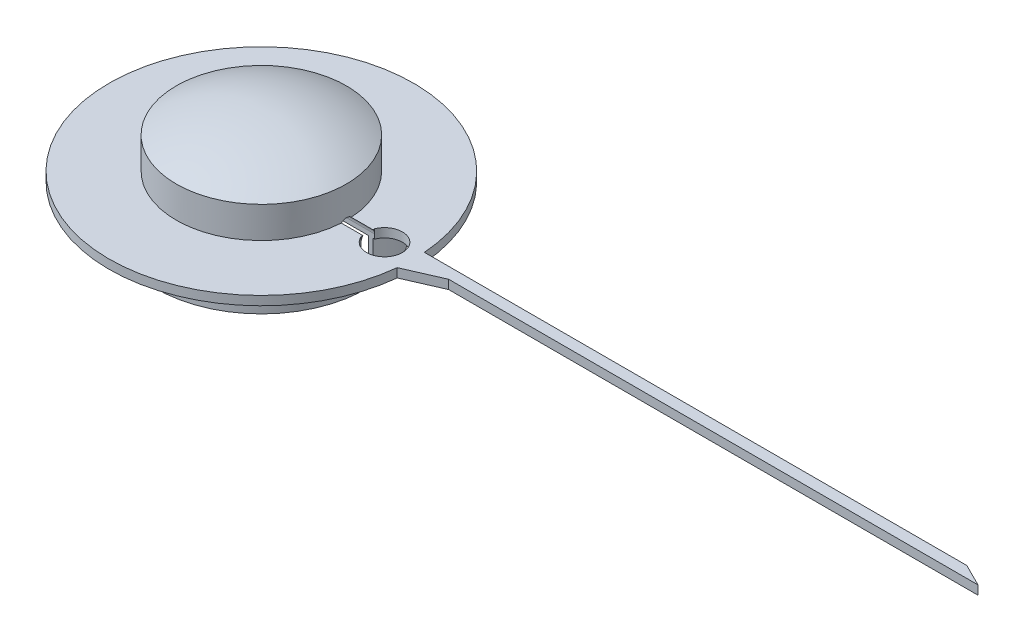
ISO-10303-21;
HEADER;
FILE_DESCRIPTION(('STEP AP214'),'2;1');
FILE_NAME('part.step','',(''),(''),'','','');
FILE_SCHEMA(('AUTOMOTIVE_DESIGN { 1 0 10303 214 1 1 1 1 }'));
ENDSEC;
DATA;
#1=APPLICATION_CONTEXT('core data for automotive mechanical design processes');
#2=APPLICATION_PROTOCOL_DEFINITION('international standard','automotive_design',2000,#1);
#3=PRODUCT_CONTEXT('',#1,'mechanical');
#4=PRODUCT('Part','Part','',(#3));
#5=PRODUCT_RELATED_PRODUCT_CATEGORY('part','',(#4));
#6=PRODUCT_DEFINITION_FORMATION('','',#4);
#7=PRODUCT_DEFINITION_CONTEXT('part definition',#1,'design');
#8=PRODUCT_DEFINITION('design','',#6,#7);
#9=PRODUCT_DEFINITION_SHAPE('','',#8);
#10=(LENGTH_UNIT() NAMED_UNIT(*) SI_UNIT(.MILLI.,.METRE.));
#11=(NAMED_UNIT(*) PLANE_ANGLE_UNIT() SI_UNIT($,.RADIAN.));
#12=(NAMED_UNIT(*) SI_UNIT($,.STERADIAN.) SOLID_ANGLE_UNIT());
#13=UNCERTAINTY_MEASURE_WITH_UNIT(LENGTH_MEASURE(1.E-05),#10,'distance_accuracy_value','');
#14=(GEOMETRIC_REPRESENTATION_CONTEXT(3) GLOBAL_UNCERTAINTY_ASSIGNED_CONTEXT((#13)) GLOBAL_UNIT_ASSIGNED_CONTEXT((#10,
#11,#12)) REPRESENTATION_CONTEXT('',''));
#15=CARTESIAN_POINT('',(0.,0.,0.));
#16=DIRECTION('',(0.,0.,1.));
#17=DIRECTION('',(1.,0.,0.));
#18=AXIS2_PLACEMENT_3D('',#15,#16,#17);
#19=CARTESIAN_POINT('',(5.,-18.5825859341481,-0.75));
#20=DIRECTION('',(0.,0.,-1.));
#21=DIRECTION('',(-1.,0.,0.));
#22=AXIS2_PLACEMENT_3D('',#19,#20,#21);
#23=PLANE('',#22);
#24=DIRECTION('',(-1.,0.,0.));
#25=VECTOR('',#24,1.);
#26=CARTESIAN_POINT('',(11.8959503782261,0.5,-0.75));
#27=LINE('',#26,#25);
#28=CARTESIAN_POINT('',(11.8959503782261,0.5,-0.75));
#29=VERTEX_POINT('',#28);
#30=CARTESIAN_POINT('',(5.,0.5,-0.75));
#31=VERTEX_POINT('',#30);
#32=EDGE_CURVE('E303',#29,#31,#27,.T.);
#33=ORIENTED_EDGE('',*,*,#32,.T.);
#34=DIRECTION('',(0.,1.,0.));
#35=VECTOR('',#34,1.);
#36=CARTESIAN_POINT('',(5.,-18.5825859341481,-0.75));
#37=LINE('',#36,#35);
#38=CARTESIAN_POINT('',(5.,0.,-0.75));
#39=VERTEX_POINT('',#38);
#40=EDGE_CURVE('E534',#39,#31,#37,.T.);
#41=ORIENTED_EDGE('',*,*,#40,.F.);
#42=DIRECTION('',(1.,0.,0.));
#43=VECTOR('',#42,1.);
#44=CARTESIAN_POINT('',(5.,0.,-0.75));
#45=LINE('',#44,#43);
#46=CARTESIAN_POINT('',(11.2249721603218,0.,-0.75));
#47=VERTEX_POINT('',#46);
#48=EDGE_CURVE('E496',#39,#47,#45,.T.);
#49=ORIENTED_EDGE('',*,*,#48,.T.);
#50=DIRECTION('',(0.,1.,0.));
#51=VECTOR('',#50,1.);
#52=CARTESIAN_POINT('',(11.2249721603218,-4.5,-0.749999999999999));
#53=LINE('',#52,#51);
#54=CARTESIAN_POINT('',(11.2249721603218,-4.5,-0.749999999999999));
#55=VERTEX_POINT('',#54);
#56=EDGE_CURVE('E470',#47,#55,#53,.F.);
#57=ORIENTED_EDGE('',*,*,#56,.T.);
#58=DIRECTION('',(-1.,0.,0.));
#59=VECTOR('',#58,1.);
#60=CARTESIAN_POINT('',(17.001,-4.5,-0.749999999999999));
#61=LINE('',#60,#59);
#62=CARTESIAN_POINT('',(11.7260393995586,-4.5,-0.749999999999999));
#63=VERTEX_POINT('',#62);
#64=EDGE_CURVE('E310',#63,#55,#61,.T.);
#65=ORIENTED_EDGE('',*,*,#64,.F.);
#66=DIRECTION('',(0.,1.,0.));
#67=VECTOR('',#66,1.);
#68=CARTESIAN_POINT('',(11.7260393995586,-4.5,-0.749999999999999));
#69=LINE('',#68,#67);
#70=CARTESIAN_POINT('',(11.7260393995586,0.,-0.75));
#71=VERTEX_POINT('',#70);
#72=EDGE_CURVE('E313',#71,#63,#69,.F.);
#73=ORIENTED_EDGE('',*,*,#72,.F.);
#74=CARTESIAN_POINT('',(11.8959503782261,0.,-0.75));
#75=VERTEX_POINT('',#74);
#76=EDGE_CURVE('E495',#71,#75,#45,.T.);
#77=ORIENTED_EDGE('',*,*,#76,.T.);
#78=DIRECTION('',(0.,1.,0.));
#79=VECTOR('',#78,1.);
#80=CARTESIAN_POINT('',(11.8959503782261,-18.5825859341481,-0.75));
#81=LINE('',#80,#79);
#82=EDGE_CURVE('E537',#75,#29,#81,.T.);
#83=ORIENTED_EDGE('',*,*,#82,.T.);
#84=EDGE_LOOP('',(#33,#41,#49,#57,#65,#73,#77,#83));
#85=FACE_BOUND('',#84,.T.);
#86=ADVANCED_FACE('F32',(#85),#23,.F.);
#87=CARTESIAN_POINT('',(0.,0.,0.));
#88=DIRECTION('',(0.,1.,0.));
#89=DIRECTION('',(0.,0.,1.));
#90=AXIS2_PLACEMENT_3D('',#87,#88,#89);
#91=PLANE('',#90);
#92=CARTESIAN_POINT('',(0.,0.,0.));
#93=DIRECTION('',(0.,1.,0.));
#94=DIRECTION('',(0.,0.,1.));
#95=AXIS2_PLACEMENT_3D('',#92,#93,#94);
#96=CIRCLE('',#95,17.);
#97=CARTESIAN_POINT('',(16.953981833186,0.,-1.25000000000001));
#98=VERTEX_POINT('',#97);
#99=CARTESIAN_POINT('',(16.9096865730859,0.,1.74999999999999));
#100=VERTEX_POINT('',#99);
#101=EDGE_CURVE('E452',#98,#100,#96,.T.);
#102=ORIENTED_EDGE('',*,*,#101,.F.);
#103=DIRECTION('',(1.,0.,0.));
#104=VECTOR('',#103,1.);
#105=CARTESIAN_POINT('',(20.9096865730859,0.,-1.25000000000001));
#106=LINE('',#105,#104);
#107=CARTESIAN_POINT('',(77.5,0.,-1.25000000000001));
#108=VERTEX_POINT('',#107);
#109=EDGE_CURVE('E670',#98,#108,#106,.T.);
#110=ORIENTED_EDGE('',*,*,#109,.T.);
#111=DIRECTION('',(0.894427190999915,0.,0.44721359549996));
#112=VECTOR('',#111,1.);
#113=CARTESIAN_POINT('',(77.5,0.,-1.25000000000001));
#114=LINE('',#113,#112);
#115=CARTESIAN_POINT('',(80.,0.,0.));
#116=VERTEX_POINT('',#115);
#117=EDGE_CURVE('E252',#108,#116,#114,.T.);
#118=ORIENTED_EDGE('',*,*,#117,.T.);
#119=DIRECTION('',(-1.,0.,0.));
#120=VECTOR('',#119,1.);
#121=CARTESIAN_POINT('',(80.,0.,0.));
#122=LINE('',#121,#120);
#123=CARTESIAN_POINT('',(20.9096865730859,0.,0.));
#124=VERTEX_POINT('',#123);
#125=EDGE_CURVE('E263',#116,#124,#122,.T.);
#126=ORIENTED_EDGE('',*,*,#125,.T.);
#127=DIRECTION('',(-0.916157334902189,0.,0.400818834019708));
#128=VECTOR('',#127,1.);
#129=CARTESIAN_POINT('',(20.9096865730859,0.,0.));
#130=LINE('',#129,#128);
#131=EDGE_CURVE('E260',#124,#100,#130,.T.);
#132=ORIENTED_EDGE('',*,*,#131,.T.);
#133=EDGE_LOOP('',(#102,#110,#118,#126,#132));
#134=FACE_BOUND('',#133,.T.);
#135=CARTESIAN_POINT('',(0.,0.,0.));
#136=DIRECTION('',(0.,-1.,0.));
#137=DIRECTION('',(0.,0.,-1.));
#138=AXIS2_PLACEMENT_3D('',#135,#136,#137);
#139=CIRCLE('',#138,11.75);
#140=CARTESIAN_POINT('',(11.7260393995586,0.,0.75));
#141=VERTEX_POINT('',#140);
#142=EDGE_CURVE('E471',#141,#71,#139,.T.);
#143=ORIENTED_EDGE('',*,*,#142,.F.);
#144=DIRECTION('',(-1.,0.,0.));
#145=VECTOR('',#144,1.);
#146=CARTESIAN_POINT('',(5.,0.,0.75));
#147=LINE('',#146,#145);
#148=CARTESIAN_POINT('',(11.8959503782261,0.,0.75));
#149=VERTEX_POINT('',#148);
#150=EDGE_CURVE('E486',#149,#141,#147,.T.);
#151=ORIENTED_EDGE('',*,*,#150,.F.);
#152=CARTESIAN_POINT('',(13.75,0.,0.));
#153=DIRECTION('',(0.,1.,0.));
#154=DIRECTION('',(0.,0.,1.));
#155=AXIS2_PLACEMENT_3D('',#152,#153,#154);
#156=CIRCLE('',#155,2.);
#157=EDGE_CURVE('E489',#75,#149,#156,.F.);
#158=ORIENTED_EDGE('',*,*,#157,.F.);
#159=ORIENTED_EDGE('',*,*,#76,.F.);
#160=EDGE_LOOP('',(#143,#151,#158,#159));
#161=FACE_BOUND('',#160,.T.);
#162=ADVANCED_FACE('F401',(#134,#161),#91,.F.);
#163=CARTESIAN_POINT('',(0.,4.,0.));
#164=DIRECTION('',(0.,1.,0.));
#165=DIRECTION('',(0.,0.,1.));
#166=AXIS2_PLACEMENT_3D('',#163,#164,#165);
#167=PLANE('',#166);
#168=CARTESIAN_POINT('',(0.,4.,0.));
#169=DIRECTION('',(0.,1.,0.));
#170=DIRECTION('',(0.,0.,1.));
#171=AXIS2_PLACEMENT_3D('',#168,#169,#170);
#172=CIRCLE('',#171,8.);
#173=CARTESIAN_POINT('',(0.,4.,8.));
#174=VERTEX_POINT('',#173);
#175=EDGE_CURVE('E464',#174,#174,#172,.T.);
#176=ORIENTED_EDGE('',*,*,#175,.F.);
#177=EDGE_LOOP('',(#176));
#178=FACE_BOUND('',#177,.T.);
#179=CARTESIAN_POINT('',(0.,4.,0.));
#180=DIRECTION('',(0.,1.,0.));
#181=DIRECTION('',(0.,0.,1.));
#182=AXIS2_PLACEMENT_3D('',#179,#180,#181);
#183=CIRCLE('',#182,1.5);
#184=CARTESIAN_POINT('',(0.,4.,1.5));
#185=VERTEX_POINT('',#184);
#186=EDGE_CURVE('E466',#185,#185,#183,.F.);
#187=ORIENTED_EDGE('',*,*,#186,.F.);
#188=EDGE_LOOP('',(#187));
#189=FACE_BOUND('',#188,.T.);
#190=ADVANCED_FACE('F386',(#178,#189),#167,.F.);
#191=CARTESIAN_POINT('',(0.,1.,0.));
#192=DIRECTION('',(0.,1.,0.));
#193=DIRECTION('',(0.,0.,1.));
#194=AXIS2_PLACEMENT_3D('',#191,#192,#193);
#195=PLANE('',#194);
#196=DIRECTION('',(0.,0.,-1.));
#197=VECTOR('',#196,1.);
#198=CARTESIAN_POINT('',(5.,1.,-2.75));
#199=LINE('',#198,#197);
#200=CARTESIAN_POINT('',(5.,1.,-0.559016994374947));
#201=VERTEX_POINT('',#200);
#202=CARTESIAN_POINT('',(5.,1.,-2.75));
#203=VERTEX_POINT('',#202);
#204=EDGE_CURVE('E518',#201,#203,#199,.T.);
#205=ORIENTED_EDGE('',*,*,#204,.F.);
#206=DIRECTION('',(-1.,0.,0.));
#207=VECTOR('',#206,1.);
#208=CARTESIAN_POINT('',(11.8959503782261,1.,-0.559016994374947));
#209=LINE('',#208,#207);
#210=CARTESIAN_POINT('',(7.98044484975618,1.,-0.559016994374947));
#211=VERTEX_POINT('',#210);
#212=EDGE_CURVE('E300',#211,#201,#209,.T.);
#213=ORIENTED_EDGE('',*,*,#212,.F.);
#214=CARTESIAN_POINT('',(0.,1.,0.));
#215=DIRECTION('',(0.,1.,0.));
#216=DIRECTION('',(0.,0.,1.));
#217=AXIS2_PLACEMENT_3D('',#214,#215,#216);
#218=CIRCLE('',#217,8.);
#219=CARTESIAN_POINT('',(7.98044484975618,1.,0.559016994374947));
#220=VERTEX_POINT('',#219);
#221=EDGE_CURVE('E451',#211,#220,#218,.T.);
#222=ORIENTED_EDGE('',*,*,#221,.T.);
#223=DIRECTION('',(-1.,0.,0.));
#224=VECTOR('',#223,1.);
#225=CARTESIAN_POINT('',(11.8959503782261,1.,0.559016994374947));
#226=LINE('',#225,#224);
#227=CARTESIAN_POINT('',(5.,1.,0.559016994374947));
#228=VERTEX_POINT('',#227);
#229=EDGE_CURVE('E290',#220,#228,#226,.T.);
#230=ORIENTED_EDGE('',*,*,#229,.T.);
#231=DIRECTION('',(0.,0.,-1.));
#232=VECTOR('',#231,1.);
#233=CARTESIAN_POINT('',(5.,1.,2.75));
#234=LINE('',#233,#232);
#235=CARTESIAN_POINT('',(5.,1.,2.75));
#236=VERTEX_POINT('',#235);
#237=EDGE_CURVE('E514',#236,#228,#234,.T.);
#238=ORIENTED_EDGE('',*,*,#237,.F.);
#239=DIRECTION('',(1.,0.,0.));
#240=VECTOR('',#239,1.);
#241=CARTESIAN_POINT('',(2.,1.,2.75));
#242=LINE('',#241,#240);
#243=CARTESIAN_POINT('',(2.,1.,2.75));
#244=VERTEX_POINT('',#243);
#245=EDGE_CURVE('E511',#244,#236,#242,.T.);
#246=ORIENTED_EDGE('',*,*,#245,.F.);
#247=DIRECTION('',(0.951351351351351,0.,0.308108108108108));
#248=VECTOR('',#247,1.);
#249=CARTESIAN_POINT('',(2.,1.,2.75));
#250=LINE('',#249,#248);
#251=CARTESIAN_POINT('',(-0.616216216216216,1.,1.9027027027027));
#252=VERTEX_POINT('',#251);
#253=EDGE_CURVE('E508',#252,#244,#250,.T.);
#254=ORIENTED_EDGE('',*,*,#253,.F.);
#255=CARTESIAN_POINT('',(0.,1.,0.));
#256=DIRECTION('',(0.,1.,0.));
#257=DIRECTION('',(0.,0.,1.));
#258=AXIS2_PLACEMENT_3D('',#255,#256,#257);
#259=CIRCLE('',#258,2.);
#260=CARTESIAN_POINT('',(-0.616216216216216,1.,-1.9027027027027));
#261=VERTEX_POINT('',#260);
#262=EDGE_CURVE('E506',#261,#252,#259,.T.);
#263=ORIENTED_EDGE('',*,*,#262,.F.);
#264=DIRECTION('',(-0.951351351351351,0.,0.308108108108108));
#265=VECTOR('',#264,1.);
#266=CARTESIAN_POINT('',(-0.616216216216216,1.,-1.9027027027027));
#267=LINE('',#266,#265);
#268=CARTESIAN_POINT('',(2.,1.,-2.75));
#269=VERTEX_POINT('',#268);
#270=EDGE_CURVE('E524',#269,#261,#267,.T.);
#271=ORIENTED_EDGE('',*,*,#270,.F.);
#272=DIRECTION('',(-1.,0.,0.));
#273=VECTOR('',#272,1.);
#274=CARTESIAN_POINT('',(2.,1.,-2.75));
#275=LINE('',#274,#273);
#276=EDGE_CURVE('E521',#203,#269,#275,.T.);
#277=ORIENTED_EDGE('',*,*,#276,.F.);
#278=EDGE_LOOP('',(#205,#213,#222,#230,#238,#246,#254,#263,#271,#277));
#279=FACE_BOUND('',#278,.T.);
#280=ADVANCED_FACE('F439',(#279),#195,.T.);
#281=CARTESIAN_POINT('',(0.,1.,0.));
#282=DIRECTION('',(0.,-1.,0.));
#283=DIRECTION('',(0.,0.,-1.));
#284=AXIS2_PLACEMENT_3D('',#281,#282,#283);
#285=CYLINDRICAL_SURFACE('',#284,17.);
#286=CARTESIAN_POINT('',(0.,1.,0.));
#287=DIRECTION('',(0.,1.,0.));
#288=DIRECTION('',(0.,0.,1.));
#289=AXIS2_PLACEMENT_3D('',#286,#287,#288);
#290=CIRCLE('',#289,17.);
#291=CARTESIAN_POINT('',(16.953981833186,1.,-1.25000000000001));
#292=VERTEX_POINT('',#291);
#293=CARTESIAN_POINT('',(16.9096865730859,1.,1.75000000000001));
#294=VERTEX_POINT('',#293);
#295=EDGE_CURVE('E448',#292,#294,#290,.T.);
#296=ORIENTED_EDGE('',*,*,#295,.F.);
#297=DIRECTION('',(0.,-1.,0.));
#298=VECTOR('',#297,1.);
#299=CARTESIAN_POINT('',(16.953981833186,64.161599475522,-1.25000000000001));
#300=LINE('',#299,#298);
#301=EDGE_CURVE('E258',#292,#98,#300,.T.);
#302=ORIENTED_EDGE('',*,*,#301,.T.);
#303=ORIENTED_EDGE('',*,*,#101,.T.);
#304=DIRECTION('',(0.,-1.,0.));
#305=VECTOR('',#304,1.);
#306=CARTESIAN_POINT('',(16.9096865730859,64.161599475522,1.74999999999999));
#307=LINE('',#306,#305);
#308=EDGE_CURVE('E268',#294,#100,#307,.T.);
#309=ORIENTED_EDGE('',*,*,#308,.F.);
#310=EDGE_LOOP('',(#296,#302,#303,#309));
#311=FACE_BOUND('',#310,.T.);
#312=ADVANCED_FACE('F438',(#311),#285,.T.);
#313=ORIENTED_EDGE('',*,*,#295,.T.);
#314=DIRECTION('',(-0.916157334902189,0.,0.400818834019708));
#315=VECTOR('',#314,1.);
#316=CARTESIAN_POINT('',(20.9096865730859,1.,0.));
#317=LINE('',#316,#315);
#318=CARTESIAN_POINT('',(20.9096865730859,1.,0.));
#319=VERTEX_POINT('',#318);
#320=EDGE_CURVE('E52',#319,#294,#317,.T.);
#321=ORIENTED_EDGE('',*,*,#320,.F.);
#322=DIRECTION('',(-1.,0.,0.));
#323=VECTOR('',#322,1.);
#324=CARTESIAN_POINT('',(80.,1.,0.));
#325=LINE('',#324,#323);
#326=CARTESIAN_POINT('',(80.,1.,0.));
#327=VERTEX_POINT('',#326);
#328=EDGE_CURVE('E243',#327,#319,#325,.T.);
#329=ORIENTED_EDGE('',*,*,#328,.F.);
#330=DIRECTION('',(0.894427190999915,0.,0.44721359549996));
#331=VECTOR('',#330,1.);
#332=CARTESIAN_POINT('',(77.5,1.,-1.25000000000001));
#333=LINE('',#332,#331);
#334=CARTESIAN_POINT('',(77.5,1.,-1.25000000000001));
#335=VERTEX_POINT('',#334);
#336=EDGE_CURVE('E234',#335,#327,#333,.T.);
#337=ORIENTED_EDGE('',*,*,#336,.F.);
#338=DIRECTION('',(1.,0.,0.));
#339=VECTOR('',#338,1.);
#340=CARTESIAN_POINT('',(20.9096865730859,1.,-1.25000000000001));
#341=LINE('',#340,#339);
#342=EDGE_CURVE('E240',#292,#335,#341,.T.);
#343=ORIENTED_EDGE('',*,*,#342,.F.);
#344=EDGE_LOOP('',(#313,#321,#329,#337,#343));
#345=FACE_BOUND('',#344,.T.);
#346=CARTESIAN_POINT('',(0.,1.,0.));
#347=DIRECTION('',(0.,1.,0.));
#348=DIRECTION('',(0.,0.,1.));
#349=AXIS2_PLACEMENT_3D('',#346,#347,#348);
#350=CIRCLE('',#349,9.5);
#351=CARTESIAN_POINT('',(9.48353836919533,1.,-0.559016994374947));
#352=VERTEX_POINT('',#351);
#353=CARTESIAN_POINT('',(9.48353836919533,1.,0.559016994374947));
#354=VERTEX_POINT('',#353);
#355=EDGE_CURVE('E454',#352,#354,#350,.T.);
#356=ORIENTED_EDGE('',*,*,#355,.F.);
#357=CARTESIAN_POINT('',(11.8959503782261,1.,-0.559016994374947));
#358=VERTEX_POINT('',#357);
#359=EDGE_CURVE('E306',#358,#352,#209,.T.);
#360=ORIENTED_EDGE('',*,*,#359,.F.);
#361=DIRECTION('',(0.,0.,-1.));
#362=VECTOR('',#361,1.);
#363=CARTESIAN_POINT('',(11.8959503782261,1.,-0.75));
#364=LINE('',#363,#362);
#365=CARTESIAN_POINT('',(11.8959503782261,1.,-0.75));
#366=VERTEX_POINT('',#365);
#367=EDGE_CURVE('E295',#358,#366,#364,.T.);
#368=ORIENTED_EDGE('',*,*,#367,.T.);
#369=CARTESIAN_POINT('',(13.75,1.,0.));
#370=DIRECTION('',(0.,1.,0.));
#371=DIRECTION('',(0.,0.,1.));
#372=AXIS2_PLACEMENT_3D('',#369,#370,#371);
#373=CIRCLE('',#372,2.);
#374=CARTESIAN_POINT('',(11.8959503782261,1.,0.749999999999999));
#375=VERTEX_POINT('',#374);
#376=EDGE_CURVE('E516',#375,#366,#373,.T.);
#377=ORIENTED_EDGE('',*,*,#376,.F.);
#378=DIRECTION('',(0.,0.,-1.));
#379=VECTOR('',#378,1.);
#380=CARTESIAN_POINT('',(11.8959503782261,1.,0.559016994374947));
#381=LINE('',#380,#379);
#382=CARTESIAN_POINT('',(11.8959503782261,1.,0.559016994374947));
#383=VERTEX_POINT('',#382);
#384=EDGE_CURVE('E281',#375,#383,#381,.T.);
#385=ORIENTED_EDGE('',*,*,#384,.T.);
#386=EDGE_CURVE('E286',#383,#354,#226,.T.);
#387=ORIENTED_EDGE('',*,*,#386,.T.);
#388=EDGE_LOOP('',(#356,#360,#368,#377,#385,#387));
#389=FACE_BOUND('',#388,.T.);
#390=ADVANCED_FACE('F237',(#345,#389),#195,.T.);
#391=CARTESIAN_POINT('',(11.2249721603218,0.,0.749999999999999));
#392=VERTEX_POINT('',#391);
#393=CARTESIAN_POINT('',(5.,0.,0.75));
#394=VERTEX_POINT('',#393);
#395=EDGE_CURVE('E475',#392,#394,#147,.T.);
#396=ORIENTED_EDGE('',*,*,#395,.F.);
#397=CARTESIAN_POINT('',(0.,0.,0.));
#398=DIRECTION('',(0.,-1.,0.));
#399=DIRECTION('',(0.,0.,-1.));
#400=AXIS2_PLACEMENT_3D('',#397,#398,#399);
#401=CIRCLE('',#400,11.25);
#402=EDGE_CURVE('E469',#392,#47,#401,.T.);
#403=ORIENTED_EDGE('',*,*,#402,.T.);
#404=ORIENTED_EDGE('',*,*,#48,.F.);
#405=DIRECTION('',(0.,0.,1.));
#406=VECTOR('',#405,1.);
#407=CARTESIAN_POINT('',(5.,0.,-2.75));
#408=LINE('',#407,#406);
#409=CARTESIAN_POINT('',(5.,0.,-2.75));
#410=VERTEX_POINT('',#409);
#411=EDGE_CURVE('E498',#410,#39,#408,.T.);
#412=ORIENTED_EDGE('',*,*,#411,.F.);
#413=DIRECTION('',(1.,0.,0.));
#414=VECTOR('',#413,1.);
#415=CARTESIAN_POINT('',(2.,0.,-2.75));
#416=LINE('',#415,#414);
#417=CARTESIAN_POINT('',(2.,0.,-2.75));
#418=VERTEX_POINT('',#417);
#419=EDGE_CURVE('E500',#418,#410,#416,.T.);
#420=ORIENTED_EDGE('',*,*,#419,.F.);
#421=DIRECTION('',(0.951351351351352,0.,-0.308108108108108));
#422=VECTOR('',#421,1.);
#423=CARTESIAN_POINT('',(-0.616216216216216,0.,-1.9027027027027));
#424=LINE('',#423,#422);
#425=CARTESIAN_POINT('',(-0.616216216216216,0.,-1.9027027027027));
#426=VERTEX_POINT('',#425);
#427=EDGE_CURVE('E502',#426,#418,#424,.T.);
#428=ORIENTED_EDGE('',*,*,#427,.F.);
#429=CARTESIAN_POINT('',(0.,0.,0.));
#430=DIRECTION('',(0.,1.,0.));
#431=DIRECTION('',(0.,0.,1.));
#432=AXIS2_PLACEMENT_3D('',#429,#430,#431);
#433=CIRCLE('',#432,2.);
#434=CARTESIAN_POINT('',(-0.616216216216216,0.,1.9027027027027));
#435=VERTEX_POINT('',#434);
#436=EDGE_CURVE('E504',#435,#426,#433,.F.);
#437=ORIENTED_EDGE('',*,*,#436,.F.);
#438=DIRECTION('',(-0.951351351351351,0.,-0.308108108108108));
#439=VECTOR('',#438,1.);
#440=CARTESIAN_POINT('',(2.,0.,2.75));
#441=LINE('',#440,#439);
#442=CARTESIAN_POINT('',(2.,0.,2.75));
#443=VERTEX_POINT('',#442);
#444=EDGE_CURVE('E456',#443,#435,#441,.T.);
#445=ORIENTED_EDGE('',*,*,#444,.F.);
#446=DIRECTION('',(-1.,0.,0.));
#447=VECTOR('',#446,1.);
#448=CARTESIAN_POINT('',(2.,0.,2.75));
#449=LINE('',#448,#447);
#450=CARTESIAN_POINT('',(5.,0.,2.75));
#451=VERTEX_POINT('',#450);
#452=EDGE_CURVE('E490',#451,#443,#449,.T.);
#453=ORIENTED_EDGE('',*,*,#452,.F.);
#454=DIRECTION('',(0.,0.,1.));
#455=VECTOR('',#454,1.);
#456=CARTESIAN_POINT('',(5.,0.,2.75));
#457=LINE('',#456,#455);
#458=EDGE_CURVE('E485',#394,#451,#457,.T.);
#459=ORIENTED_EDGE('',*,*,#458,.F.);
#460=EDGE_LOOP('',(#396,#403,#404,#412,#420,#428,#437,#445,#453,#459));
#461=FACE_BOUND('',#460,.T.);
#462=ADVANCED_FACE('F409',(#461),#91,.F.);
#463=CARTESIAN_POINT('',(0.,-18.5825859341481,0.));
#464=DIRECTION('',(0.,1.,0.));
#465=DIRECTION('',(0.,0.,1.));
#466=AXIS2_PLACEMENT_3D('',#463,#464,#465);
#467=CYLINDRICAL_SURFACE('',#466,2.);
#468=ORIENTED_EDGE('',*,*,#436,.T.);
#469=DIRECTION('',(0.,1.,0.));
#470=VECTOR('',#469,1.);
#471=CARTESIAN_POINT('',(-0.616216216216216,-18.5825859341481,-1.9027027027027));
#472=LINE('',#471,#470);
#473=EDGE_CURVE('E528',#426,#261,#472,.T.);
#474=ORIENTED_EDGE('',*,*,#473,.T.);
#475=ORIENTED_EDGE('',*,*,#262,.T.);
#476=DIRECTION('',(0.,1.,0.));
#477=VECTOR('',#476,1.);
#478=CARTESIAN_POINT('',(-0.616216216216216,-18.5825859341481,1.9027027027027));
#479=LINE('',#478,#477);
#480=EDGE_CURVE('E527',#435,#252,#479,.T.);
#481=ORIENTED_EDGE('',*,*,#480,.F.);
#482=EDGE_LOOP('',(#468,#474,#475,#481));
#483=FACE_BOUND('',#482,.T.);
#484=ADVANCED_FACE('F432',(#483),#467,.F.);
#485=CARTESIAN_POINT('',(-0.616216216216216,-18.5825859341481,-1.9027027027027));
#486=DIRECTION('',(-0.308108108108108,0.,-0.951351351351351));
#487=DIRECTION('',(-0.951351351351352,0.,0.308108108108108));
#488=AXIS2_PLACEMENT_3D('',#485,#486,#487);
#489=PLANE('',#488);
#490=ORIENTED_EDGE('',*,*,#427,.T.);
#491=DIRECTION('',(0.,1.,0.));
#492=VECTOR('',#491,1.);
#493=CARTESIAN_POINT('',(2.,-18.5825859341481,-2.75));
#494=LINE('',#493,#492);
#495=EDGE_CURVE('E530',#418,#269,#494,.T.);
#496=ORIENTED_EDGE('',*,*,#495,.T.);
#497=ORIENTED_EDGE('',*,*,#270,.T.);
#498=ORIENTED_EDGE('',*,*,#473,.F.);
#499=EDGE_LOOP('',(#490,#496,#497,#498));
#500=FACE_BOUND('',#499,.T.);
#501=ADVANCED_FACE('F435',(#500),#489,.F.);
#502=CARTESIAN_POINT('',(2.,-18.5825859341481,-2.75));
#503=DIRECTION('',(0.,0.,-1.));
#504=DIRECTION('',(-1.,0.,0.));
#505=AXIS2_PLACEMENT_3D('',#502,#503,#504);
#506=PLANE('',#505);
#507=ORIENTED_EDGE('',*,*,#419,.T.);
#508=DIRECTION('',(0.,1.,0.));
#509=VECTOR('',#508,1.);
#510=CARTESIAN_POINT('',(5.,-18.5825859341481,-2.75));
#511=LINE('',#510,#509);
#512=EDGE_CURVE('E532',#410,#203,#511,.T.);
#513=ORIENTED_EDGE('',*,*,#512,.T.);
#514=ORIENTED_EDGE('',*,*,#276,.T.);
#515=ORIENTED_EDGE('',*,*,#495,.F.);
#516=EDGE_LOOP('',(#507,#513,#514,#515));
#517=FACE_BOUND('',#516,.T.);
#518=ADVANCED_FACE('F568',(#517),#506,.F.);
#519=CARTESIAN_POINT('',(5.,-18.5825859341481,-2.75));
#520=DIRECTION('',(1.,0.,0.));
#521=DIRECTION('',(0.,0.,-1.));
#522=AXIS2_PLACEMENT_3D('',#519,#520,#521);
#523=PLANE('',#522);
#524=ORIENTED_EDGE('',*,*,#411,.T.);
#525=ORIENTED_EDGE('',*,*,#40,.T.);
#526=CARTESIAN_POINT('',(5.,0.5,0.));
#527=DIRECTION('',(1.,0.,0.));
#528=DIRECTION('',(0.,0.,1.));
#529=AXIS2_PLACEMENT_3D('',#526,#527,#528);
#530=CIRCLE('',#529,0.75);
#531=EDGE_CURVE('E289',#31,#201,#530,.T.);
#532=ORIENTED_EDGE('',*,*,#531,.T.);
#533=ORIENTED_EDGE('',*,*,#204,.T.);
#534=ORIENTED_EDGE('',*,*,#512,.F.);
#535=EDGE_LOOP('',(#524,#525,#532,#533,#534));
#536=FACE_BOUND('',#535,.T.);
#537=ADVANCED_FACE('F412',(#536),#523,.F.);
#538=CARTESIAN_POINT('',(13.75,-18.5825859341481,0.));
#539=DIRECTION('',(0.,1.,0.));
#540=DIRECTION('',(0.,0.,1.));
#541=AXIS2_PLACEMENT_3D('',#538,#539,#540);
#542=CYLINDRICAL_SURFACE('',#541,2.);
#543=ORIENTED_EDGE('',*,*,#376,.T.);
#544=DIRECTION('',(0.,-1.,0.));
#545=VECTOR('',#544,1.);
#546=CARTESIAN_POINT('',(11.8959503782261,0.5,-0.75));
#547=LINE('',#546,#545);
#548=EDGE_CURVE('E298',#366,#29,#547,.T.);
#549=ORIENTED_EDGE('',*,*,#548,.T.);
#550=ORIENTED_EDGE('',*,*,#82,.F.);
#551=ORIENTED_EDGE('',*,*,#157,.T.);
#552=DIRECTION('',(0.,1.,0.));
#553=VECTOR('',#552,1.);
#554=CARTESIAN_POINT('',(11.8959503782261,-18.5825859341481,0.749999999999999));
#555=LINE('',#554,#553);
#556=CARTESIAN_POINT('',(11.8959503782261,0.5,0.749999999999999));
#557=VERTEX_POINT('',#556);
#558=EDGE_CURVE('E540',#149,#557,#555,.T.);
#559=ORIENTED_EDGE('',*,*,#558,.T.);
#560=DIRECTION('',(0.,1.,0.));
#561=VECTOR('',#560,1.);
#562=CARTESIAN_POINT('',(11.8959503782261,1.,0.75));
#563=LINE('',#562,#561);
#564=EDGE_CURVE('E279',#557,#375,#563,.T.);
#565=ORIENTED_EDGE('',*,*,#564,.T.);
#566=EDGE_LOOP('',(#543,#549,#550,#551,#559,#565));
#567=FACE_BOUND('',#566,.T.);
#568=ADVANCED_FACE('F414',(#567),#542,.F.);
#569=CARTESIAN_POINT('',(5.,-18.5825859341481,0.75));
#570=DIRECTION('',(0.,0.,1.));
#571=DIRECTION('',(1.,0.,0.));
#572=AXIS2_PLACEMENT_3D('',#569,#570,#571);
#573=PLANE('',#572);
#574=DIRECTION('',(0.,1.,0.));
#575=VECTOR('',#574,1.);
#576=CARTESIAN_POINT('',(5.,-18.5825859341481,0.75));
#577=LINE('',#576,#575);
#578=CARTESIAN_POINT('',(5.,0.5,0.75));
#579=VERTEX_POINT('',#578);
#580=EDGE_CURVE('E542',#394,#579,#577,.T.);
#581=ORIENTED_EDGE('',*,*,#580,.T.);
#582=DIRECTION('',(-1.,0.,0.));
#583=VECTOR('',#582,1.);
#584=CARTESIAN_POINT('',(11.8959503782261,0.5,0.75));
#585=LINE('',#584,#583);
#586=EDGE_CURVE('E60',#557,#579,#585,.T.);
#587=ORIENTED_EDGE('',*,*,#586,.F.);
#588=ORIENTED_EDGE('',*,*,#558,.F.);
#589=ORIENTED_EDGE('',*,*,#150,.T.);
#590=DIRECTION('',(0.,1.,0.));
#591=VECTOR('',#590,1.);
#592=CARTESIAN_POINT('',(11.7260393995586,-4.5,0.749999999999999));
#593=LINE('',#592,#591);
#594=CARTESIAN_POINT('',(11.7260393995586,-4.5,0.749999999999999));
#595=VERTEX_POINT('',#594);
#596=EDGE_CURVE('E316',#595,#141,#593,.T.);
#597=ORIENTED_EDGE('',*,*,#596,.F.);
#598=DIRECTION('',(-1.,0.,0.));
#599=VECTOR('',#598,1.);
#600=CARTESIAN_POINT('',(17.001,-4.5,0.749999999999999));
#601=LINE('',#600,#599);
#602=CARTESIAN_POINT('',(11.2249721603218,-4.5,0.749999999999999));
#603=VERTEX_POINT('',#602);
#604=EDGE_CURVE('E305',#595,#603,#601,.T.);
#605=ORIENTED_EDGE('',*,*,#604,.T.);
#606=DIRECTION('',(0.,1.,0.));
#607=VECTOR('',#606,1.);
#608=CARTESIAN_POINT('',(11.2249721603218,-4.5,0.749999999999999));
#609=LINE('',#608,#607);
#610=EDGE_CURVE('E45',#603,#392,#609,.T.);
#611=ORIENTED_EDGE('',*,*,#610,.T.);
#612=ORIENTED_EDGE('',*,*,#395,.T.);
#613=EDGE_LOOP('',(#581,#587,#588,#589,#597,#605,#611,#612));
#614=FACE_BOUND('',#613,.T.);
#615=ADVANCED_FACE('F417',(#614),#573,.F.);
#616=CARTESIAN_POINT('',(5.,-18.5825859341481,2.75));
#617=DIRECTION('',(1.,0.,0.));
#618=DIRECTION('',(0.,0.,-1.));
#619=AXIS2_PLACEMENT_3D('',#616,#617,#618);
#620=PLANE('',#619);
#621=ORIENTED_EDGE('',*,*,#458,.T.);
#622=DIRECTION('',(0.,1.,0.));
#623=VECTOR('',#622,1.);
#624=CARTESIAN_POINT('',(5.,-18.5825859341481,2.75));
#625=LINE('',#624,#623);
#626=EDGE_CURVE('E544',#451,#236,#625,.T.);
#627=ORIENTED_EDGE('',*,*,#626,.T.);
#628=ORIENTED_EDGE('',*,*,#237,.T.);
#629=CARTESIAN_POINT('',(5.,0.5,0.));
#630=DIRECTION('',(1.,0.,0.));
#631=DIRECTION('',(0.,0.,1.));
#632=AXIS2_PLACEMENT_3D('',#629,#630,#631);
#633=CIRCLE('',#632,0.75);
#634=EDGE_CURVE('E272',#228,#579,#633,.T.);
#635=ORIENTED_EDGE('',*,*,#634,.T.);
#636=ORIENTED_EDGE('',*,*,#580,.F.);
#637=EDGE_LOOP('',(#621,#627,#628,#635,#636));
#638=FACE_BOUND('',#637,.T.);
#639=ADVANCED_FACE('F421',(#638),#620,.F.);
#640=CARTESIAN_POINT('',(2.,-18.5825859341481,2.75));
#641=DIRECTION('',(0.,0.,1.));
#642=DIRECTION('',(1.,0.,0.));
#643=AXIS2_PLACEMENT_3D('',#640,#641,#642);
#644=PLANE('',#643);
#645=ORIENTED_EDGE('',*,*,#452,.T.);
#646=DIRECTION('',(0.,1.,0.));
#647=VECTOR('',#646,1.);
#648=CARTESIAN_POINT('',(2.,-18.5825859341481,2.75));
#649=LINE('',#648,#647);
#650=EDGE_CURVE('E546',#443,#244,#649,.T.);
#651=ORIENTED_EDGE('',*,*,#650,.T.);
#652=ORIENTED_EDGE('',*,*,#245,.T.);
#653=ORIENTED_EDGE('',*,*,#626,.F.);
#654=EDGE_LOOP('',(#645,#651,#652,#653));
#655=FACE_BOUND('',#654,.T.);
#656=ADVANCED_FACE('F424',(#655),#644,.F.);
#657=CARTESIAN_POINT('',(2.,-18.5825859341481,2.75));
#658=DIRECTION('',(-0.308108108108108,0.,0.951351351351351));
#659=DIRECTION('',(0.951351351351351,0.,0.308108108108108));
#660=AXIS2_PLACEMENT_3D('',#657,#658,#659);
#661=PLANE('',#660);
#662=ORIENTED_EDGE('',*,*,#444,.T.);
#663=ORIENTED_EDGE('',*,*,#480,.T.);
#664=ORIENTED_EDGE('',*,*,#253,.T.);
#665=ORIENTED_EDGE('',*,*,#650,.F.);
#666=EDGE_LOOP('',(#662,#663,#664,#665));
#667=FACE_BOUND('',#666,.T.);
#668=ADVANCED_FACE('F396',(#667),#661,.F.);
#669=CARTESIAN_POINT('',(0.,4.,0.));
#670=DIRECTION('',(0.,-1.,0.));
#671=DIRECTION('',(0.,0.,-1.));
#672=AXIS2_PLACEMENT_3D('',#669,#670,#671);
#673=CYLINDRICAL_SURFACE('',#672,9.5);
#674=ORIENTED_EDGE('',*,*,#355,.T.);
#675=CARTESIAN_POINT('',(9.48353836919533,1.,0.559016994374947));
#676=CARTESIAN_POINT('',(9.48519841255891,1.03146666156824,0.530919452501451));
#677=CARTESIAN_POINT('',(9.48688502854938,1.06050702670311,0.500125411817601));
#678=CARTESIAN_POINT('',(9.49013154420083,1.11301672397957,0.434134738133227));
#679=CARTESIAN_POINT('',(9.49169153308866,1.1364900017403,0.398941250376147));
#680=CARTESIAN_POINT('',(9.49450853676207,1.17720444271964,0.325080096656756));
#681=CARTESIAN_POINT('',(9.49576539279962,1.19444234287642,0.2864106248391));
#682=CARTESIAN_POINT('',(9.49783405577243,1.22218040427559,0.206722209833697));
#683=CARTESIAN_POINT('',(9.49864593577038,1.23268167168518,0.165703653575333));
#684=CARTESIAN_POINT('',(9.49973211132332,1.24663182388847,0.0825534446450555));
#685=CARTESIAN_POINT('',(9.50000737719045,1.25009343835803,0.0404239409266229));
#686=CARTESIAN_POINT('',(9.49999231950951,1.24990271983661,-0.0438188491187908));
#687=CARTESIAN_POINT('',(9.49970199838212,1.24625041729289,-0.0859321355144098));
#688=CARTESIAN_POINT('',(9.49858947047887,1.23195076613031,-0.168864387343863));
#689=CARTESIAN_POINT('',(9.49776825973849,1.22131651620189,-0.209685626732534));
#690=CARTESIAN_POINT('',(9.49568699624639,1.19337163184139,-0.288970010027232));
#691=CARTESIAN_POINT('',(9.49442688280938,1.17606007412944,-0.327432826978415));
#692=CARTESIAN_POINT('',(9.49161723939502,1.13537861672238,-0.400666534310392));
#693=CARTESIAN_POINT('',(9.49006964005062,1.11204874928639,-0.43545975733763));
#694=CARTESIAN_POINT('',(9.48685213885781,1.05994109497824,-0.500723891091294));
#695=CARTESIAN_POINT('',(9.48518215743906,1.03115974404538,-0.531191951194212));
#696=CARTESIAN_POINT('',(9.48353836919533,1.,-0.559016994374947));
#697=B_SPLINE_CURVE_WITH_KNOTS('',3,(#675,#676,#677,#678,#679,#680,#681,#682,#683,#684,#685,
#686,#687,#688,#689,#690,#691,#692,#693,#694,#695,#696),.UNSPECIFIED.,.F.,.F.,(4,2,2,2,2,2,2,2,
2,2,4),(0.,0.126488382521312,0.252886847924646,0.379351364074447,0.505795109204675,
0.632010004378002,0.758224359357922,0.884202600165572,1.01019826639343,1.13537653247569,
1.26063692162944),.UNSPECIFIED.);
#698=EDGE_CURVE('E318',#354,#352,#697,.T.);
#699=ORIENTED_EDGE('',*,*,#698,.T.);
#700=EDGE_LOOP('',(#674,#699));
#701=FACE_BOUND('',#700,.T.);
#702=CARTESIAN_POINT('',(0.,4.5,0.));
#703=DIRECTION('',(0.,1.,0.));
#704=DIRECTION('',(0.,0.,1.));
#705=AXIS2_PLACEMENT_3D('',#702,#703,#704);
#706=CIRCLE('',#705,9.5);
#707=CARTESIAN_POINT('',(0.,4.5,9.5));
#708=VERTEX_POINT('',#707);
#709=EDGE_CURVE('E461',#708,#708,#706,.T.);
#710=ORIENTED_EDGE('',*,*,#709,.F.);
#711=EDGE_LOOP('',(#710));
#712=FACE_BOUND('',#711,.T.);
#713=ADVANCED_FACE('F327',(#701,#712),#673,.T.);
#714=CARTESIAN_POINT('',(0.,4.,0.));
#715=DIRECTION('',(0.,-1.,0.));
#716=DIRECTION('',(0.,0.,-1.));
#717=AXIS2_PLACEMENT_3D('',#714,#715,#716);
#718=CYLINDRICAL_SURFACE('',#717,8.);
#719=CARTESIAN_POINT('',(7.98044484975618,1.,0.559016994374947));
#720=CARTESIAN_POINT('',(7.9824173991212,1.03146364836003,0.530921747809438));
#721=CARTESIAN_POINT('',(7.98442126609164,1.06050178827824,0.500130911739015));
#722=CARTESIAN_POINT('',(7.98827827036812,1.1130102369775,0.434143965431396));
#723=CARTESIAN_POINT('',(7.99013150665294,1.13648422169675,0.398950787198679));
#724=CARTESIAN_POINT('',(7.99347796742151,1.17720212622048,0.325085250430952));
#725=CARTESIAN_POINT('',(7.99497099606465,1.19444265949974,0.286411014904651));
#726=CARTESIAN_POINT('',(7.99742823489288,1.2221847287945,0.206708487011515));
#727=CARTESIAN_POINT('',(7.99839254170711,1.23268749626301,0.165680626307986));
#728=CARTESIAN_POINT('',(7.99968191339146,1.24663203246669,0.0825405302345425));
#729=CARTESIAN_POINT('',(8.00000861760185,1.25009191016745,0.0404313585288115));
#730=CARTESIAN_POINT('',(7.99999103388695,1.24990437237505,-0.0437708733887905));
#731=CARTESIAN_POINT('',(7.99964675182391,1.24625701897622,-0.0858639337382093));
#732=CARTESIAN_POINT('',(7.9983276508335,1.23198010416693,-0.168724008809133));
#733=CARTESIAN_POINT('',(7.9973544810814,1.22136880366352,-0.209494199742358));
#734=CARTESIAN_POINT('',(7.99488804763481,1.19348846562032,-0.288681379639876));
#735=CARTESIAN_POINT('',(7.99339470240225,1.17621838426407,-0.327097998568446));
#736=CARTESIAN_POINT('',(7.99005905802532,1.13557204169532,-0.400367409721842));
#737=CARTESIAN_POINT('',(7.98821791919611,1.11221598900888,-0.435231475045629));
#738=CARTESIAN_POINT('',(7.9843892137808,1.0600376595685,-0.500621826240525));
#739=CARTESIAN_POINT('',(7.98240155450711,1.03121190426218,-0.531145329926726));
#740=CARTESIAN_POINT('',(7.98044484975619,1.,-0.559016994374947));
#741=B_SPLINE_CURVE_WITH_KNOTS('',3,(#719,#720,#721,#722,#723,#724,#725,#726,#727,#728,#729,
#730,#731,#732,#733,#734,#735,#736,#737,#738,#739,#740),.UNSPECIFIED.,.F.,.F.,(4,2,2,2,2,2,2,2,
2,2,4),(0.,0.126518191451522,0.252952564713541,0.379455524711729,0.505935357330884,
0.632089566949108,0.758242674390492,0.884066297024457,1.00990965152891,1.13534035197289,
1.26085109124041),.UNSPECIFIED.);
#742=EDGE_CURVE('E11',#220,#211,#741,.T.);
#743=ORIENTED_EDGE('',*,*,#742,.F.);
#744=ORIENTED_EDGE('',*,*,#221,.F.);
#745=EDGE_LOOP('',(#743,#744));
#746=FACE_BOUND('',#745,.T.);
#747=ORIENTED_EDGE('',*,*,#175,.T.);
#748=EDGE_LOOP('',(#747));
#749=FACE_BOUND('',#748,.T.);
#750=ADVANCED_FACE('F387',(#746,#749),#718,.F.);
#751=CARTESIAN_POINT('',(0.,-12.3,0.));
#752=DIRECTION('',(0.,0.,1.));
#753=DIRECTION('',(1.,0.,0.));
#754=AXIS2_PLACEMENT_3D('',#751,#752,#753);
#755=SPHERICAL_SURFACE('',#754,19.3);
#756=CARTESIAN_POINT('',(0.,-12.3,0.));
#757=DIRECTION('',(0.,1.,0.));
#758=DIRECTION('',(0.,0.,1.));
#759=AXIS2_PLACEMENT_3D('',#756,#757,#758);
#760=SPHERICAL_SURFACE('',#759,19.3);
#761=ORIENTED_EDGE('',*,*,#709,.T.);
#762=EDGE_LOOP('',(#761));
#763=FACE_BOUND('',#762,.T.);
#764=ADVANCED_FACE('F34',(#763),#760,.T.);
#765=CARTESIAN_POINT('',(0.,1.,0.));
#766=DIRECTION('',(0.,-1.,0.));
#767=DIRECTION('',(0.,0.,-1.));
#768=AXIS2_PLACEMENT_3D('',#765,#766,#767);
#769=PLANE('',#768);
#770=CARTESIAN_POINT('',(0.,1.,0.));
#771=DIRECTION('',(0.,-1.,0.));
#772=DIRECTION('',(0.,0.,-1.));
#773=AXIS2_PLACEMENT_3D('',#770,#771,#772);
#774=CIRCLE('',#773,1.5);
#775=CARTESIAN_POINT('',(0.,1.,-1.5));
#776=VERTEX_POINT('',#775);
#777=EDGE_CURVE('E465',#776,#776,#774,.T.);
#778=ORIENTED_EDGE('',*,*,#777,.T.);
#779=EDGE_LOOP('',(#778));
#780=FACE_BOUND('',#779,.T.);
#781=DIRECTION('',(-0.5,0.,0.866025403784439));
#782=VECTOR('',#781,1.);
#783=CARTESIAN_POINT('',(1.,1.,0.));
#784=LINE('',#783,#782);
#785=CARTESIAN_POINT('',(1.,1.,0.));
#786=VERTEX_POINT('',#785);
#787=CARTESIAN_POINT('',(0.5,1.,0.866025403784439));
#788=VERTEX_POINT('',#787);
#789=EDGE_CURVE('E600',#786,#788,#784,.T.);
#790=ORIENTED_EDGE('',*,*,#789,.F.);
#791=DIRECTION('',(0.5,0.,0.866025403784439));
#792=VECTOR('',#791,1.);
#793=CARTESIAN_POINT('',(0.5,1.,-0.866025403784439));
#794=LINE('',#793,#792);
#795=CARTESIAN_POINT('',(0.5,1.,-0.866025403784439));
#796=VERTEX_POINT('',#795);
#797=EDGE_CURVE('E598',#796,#786,#794,.T.);
#798=ORIENTED_EDGE('',*,*,#797,.F.);
#799=DIRECTION('',(1.,0.,0.));
#800=VECTOR('',#799,1.);
#801=CARTESIAN_POINT('',(-0.5,1.,-0.866025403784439));
#802=LINE('',#801,#800);
#803=CARTESIAN_POINT('',(-0.5,1.,-0.866025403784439));
#804=VERTEX_POINT('',#803);
#805=EDGE_CURVE('E610',#804,#796,#802,.T.);
#806=ORIENTED_EDGE('',*,*,#805,.F.);
#807=DIRECTION('',(0.5,0.,-0.866025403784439));
#808=VECTOR('',#807,1.);
#809=CARTESIAN_POINT('',(-1.,1.,0.));
#810=LINE('',#809,#808);
#811=CARTESIAN_POINT('',(-1.,1.,0.));
#812=VERTEX_POINT('',#811);
#813=EDGE_CURVE('E607',#812,#804,#810,.T.);
#814=ORIENTED_EDGE('',*,*,#813,.F.);
#815=DIRECTION('',(-0.5,0.,-0.866025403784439));
#816=VECTOR('',#815,1.);
#817=CARTESIAN_POINT('',(-0.5,1.,0.866025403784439));
#818=LINE('',#817,#816);
#819=CARTESIAN_POINT('',(-0.5,1.,0.866025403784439));
#820=VERTEX_POINT('',#819);
#821=EDGE_CURVE('E605',#820,#812,#818,.T.);
#822=ORIENTED_EDGE('',*,*,#821,.F.);
#823=DIRECTION('',(-1.,0.,0.));
#824=VECTOR('',#823,1.);
#825=CARTESIAN_POINT('',(0.5,1.,0.866025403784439));
#826=LINE('',#825,#824);
#827=EDGE_CURVE('E603',#788,#820,#826,.T.);
#828=ORIENTED_EDGE('',*,*,#827,.F.);
#829=EDGE_LOOP('',(#790,#798,#806,#814,#822,#828));
#830=FACE_BOUND('',#829,.T.);
#831=ADVANCED_FACE('F377',(#780,#830),#769,.T.);
#832=CARTESIAN_POINT('',(0.,1.,0.));
#833=DIRECTION('',(0.,1.,0.));
#834=DIRECTION('',(0.,0.,1.));
#835=AXIS2_PLACEMENT_3D('',#832,#833,#834);
#836=CYLINDRICAL_SURFACE('',#835,1.5);
#837=ORIENTED_EDGE('',*,*,#777,.F.);
#838=EDGE_LOOP('',(#837));
#839=FACE_BOUND('',#838,.T.);
#840=ORIENTED_EDGE('',*,*,#186,.T.);
#841=EDGE_LOOP('',(#840));
#842=FACE_BOUND('',#841,.T.);
#843=ADVANCED_FACE('F375',(#839,#842),#836,.T.);
#844=CARTESIAN_POINT('',(0.5,1.,-0.866025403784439));
#845=DIRECTION('',(-0.866025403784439,0.,0.5));
#846=DIRECTION('',(0.5,0.,0.866025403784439));
#847=AXIS2_PLACEMENT_3D('',#844,#845,#846);
#848=PLANE('',#847);
#849=DIRECTION('',(0.5,0.,0.866025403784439));
#850=VECTOR('',#849,1.);
#851=CARTESIAN_POINT('',(0.5,4.,-0.866025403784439));
#852=LINE('',#851,#850);
#853=CARTESIAN_POINT('',(0.5,4.,-0.866025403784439));
#854=VERTEX_POINT('',#853);
#855=CARTESIAN_POINT('',(1.,4.,0.));
#856=VERTEX_POINT('',#855);
#857=EDGE_CURVE('E613',#854,#856,#852,.T.);
#858=ORIENTED_EDGE('',*,*,#857,.F.);
#859=DIRECTION('',(0.,1.,0.));
#860=VECTOR('',#859,1.);
#861=CARTESIAN_POINT('',(0.5,1.,-0.866025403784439));
#862=LINE('',#861,#860);
#863=EDGE_CURVE('E612',#796,#854,#862,.T.);
#864=ORIENTED_EDGE('',*,*,#863,.F.);
#865=ORIENTED_EDGE('',*,*,#797,.T.);
#866=DIRECTION('',(0.,1.,0.));
#867=VECTOR('',#866,1.);
#868=CARTESIAN_POINT('',(1.,1.,0.));
#869=LINE('',#868,#867);
#870=EDGE_CURVE('E639',#786,#856,#869,.T.);
#871=ORIENTED_EDGE('',*,*,#870,.T.);
#872=EDGE_LOOP('',(#858,#864,#865,#871));
#873=FACE_BOUND('',#872,.T.);
#874=ADVANCED_FACE('F371',(#873),#848,.T.);
#875=CARTESIAN_POINT('',(1.,1.,0.));
#876=DIRECTION('',(-0.866025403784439,0.,-0.5));
#877=DIRECTION('',(-0.5,0.,0.866025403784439));
#878=AXIS2_PLACEMENT_3D('',#875,#876,#877);
#879=PLANE('',#878);
#880=DIRECTION('',(-0.5,0.,0.866025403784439));
#881=VECTOR('',#880,1.);
#882=CARTESIAN_POINT('',(1.,4.,0.));
#883=LINE('',#882,#881);
#884=CARTESIAN_POINT('',(0.5,4.,0.866025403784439));
#885=VERTEX_POINT('',#884);
#886=EDGE_CURVE('E616',#856,#885,#883,.T.);
#887=ORIENTED_EDGE('',*,*,#886,.F.);
#888=ORIENTED_EDGE('',*,*,#870,.F.);
#889=ORIENTED_EDGE('',*,*,#789,.T.);
#890=DIRECTION('',(0.,1.,0.));
#891=VECTOR('',#890,1.);
#892=CARTESIAN_POINT('',(0.5,1.,0.866025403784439));
#893=LINE('',#892,#891);
#894=EDGE_CURVE('E637',#788,#885,#893,.T.);
#895=ORIENTED_EDGE('',*,*,#894,.T.);
#896=EDGE_LOOP('',(#887,#888,#889,#895));
#897=FACE_BOUND('',#896,.T.);
#898=ADVANCED_FACE('F367',(#897),#879,.T.);
#899=CARTESIAN_POINT('',(0.5,1.,0.866025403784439));
#900=DIRECTION('',(0.,0.,-1.));
#901=DIRECTION('',(-1.,0.,0.));
#902=AXIS2_PLACEMENT_3D('',#899,#900,#901);
#903=PLANE('',#902);
#904=DIRECTION('',(-1.,0.,0.));
#905=VECTOR('',#904,1.);
#906=CARTESIAN_POINT('',(0.5,4.,0.866025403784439));
#907=LINE('',#906,#905);
#908=CARTESIAN_POINT('',(-0.5,4.,0.866025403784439));
#909=VERTEX_POINT('',#908);
#910=EDGE_CURVE('E619',#885,#909,#907,.T.);
#911=ORIENTED_EDGE('',*,*,#910,.F.);
#912=ORIENTED_EDGE('',*,*,#894,.F.);
#913=ORIENTED_EDGE('',*,*,#827,.T.);
#914=DIRECTION('',(0.,1.,0.));
#915=VECTOR('',#914,1.);
#916=CARTESIAN_POINT('',(-0.5,1.,0.866025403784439));
#917=LINE('',#916,#915);
#918=EDGE_CURVE('E635',#820,#909,#917,.T.);
#919=ORIENTED_EDGE('',*,*,#918,.T.);
#920=EDGE_LOOP('',(#911,#912,#913,#919));
#921=FACE_BOUND('',#920,.T.);
#922=ADVANCED_FACE('F363',(#921),#903,.T.);
#923=CARTESIAN_POINT('',(-0.5,1.,0.866025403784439));
#924=DIRECTION('',(0.866025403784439,0.,-0.5));
#925=DIRECTION('',(-0.5,0.,-0.866025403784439));
#926=AXIS2_PLACEMENT_3D('',#923,#924,#925);
#927=PLANE('',#926);
#928=DIRECTION('',(-0.5,0.,-0.866025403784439));
#929=VECTOR('',#928,1.);
#930=CARTESIAN_POINT('',(-0.5,4.,0.866025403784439));
#931=LINE('',#930,#929);
#932=CARTESIAN_POINT('',(-1.,4.,0.));
#933=VERTEX_POINT('',#932);
#934=EDGE_CURVE('E622',#909,#933,#931,.T.);
#935=ORIENTED_EDGE('',*,*,#934,.F.);
#936=ORIENTED_EDGE('',*,*,#918,.F.);
#937=ORIENTED_EDGE('',*,*,#821,.T.);
#938=DIRECTION('',(0.,1.,0.));
#939=VECTOR('',#938,1.);
#940=CARTESIAN_POINT('',(-1.,1.,0.));
#941=LINE('',#940,#939);
#942=EDGE_CURVE('E633',#812,#933,#941,.T.);
#943=ORIENTED_EDGE('',*,*,#942,.T.);
#944=EDGE_LOOP('',(#935,#936,#937,#943));
#945=FACE_BOUND('',#944,.T.);
#946=ADVANCED_FACE('F359',(#945),#927,.T.);
#947=CARTESIAN_POINT('',(-1.,1.,0.));
#948=DIRECTION('',(0.866025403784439,0.,0.5));
#949=DIRECTION('',(0.5,0.,-0.866025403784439));
#950=AXIS2_PLACEMENT_3D('',#947,#948,#949);
#951=PLANE('',#950);
#952=DIRECTION('',(0.5,0.,-0.866025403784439));
#953=VECTOR('',#952,1.);
#954=CARTESIAN_POINT('',(-1.,4.,0.));
#955=LINE('',#954,#953);
#956=CARTESIAN_POINT('',(-0.5,4.,-0.866025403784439));
#957=VERTEX_POINT('',#956);
#958=EDGE_CURVE('E625',#933,#957,#955,.T.);
#959=ORIENTED_EDGE('',*,*,#958,.F.);
#960=ORIENTED_EDGE('',*,*,#942,.F.);
#961=ORIENTED_EDGE('',*,*,#813,.T.);
#962=DIRECTION('',(0.,1.,0.));
#963=VECTOR('',#962,1.);
#964=CARTESIAN_POINT('',(-0.5,1.,-0.866025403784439));
#965=LINE('',#964,#963);
#966=EDGE_CURVE('E631',#804,#957,#965,.T.);
#967=ORIENTED_EDGE('',*,*,#966,.T.);
#968=EDGE_LOOP('',(#959,#960,#961,#967));
#969=FACE_BOUND('',#968,.T.);
#970=ADVANCED_FACE('F355',(#969),#951,.T.);
#971=CARTESIAN_POINT('',(-0.5,1.,-0.866025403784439));
#972=DIRECTION('',(0.,0.,1.));
#973=DIRECTION('',(1.,0.,0.));
#974=AXIS2_PLACEMENT_3D('',#971,#972,#973);
#975=PLANE('',#974);
#976=DIRECTION('',(1.,0.,0.));
#977=VECTOR('',#976,1.);
#978=CARTESIAN_POINT('',(-0.5,4.,-0.866025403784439));
#979=LINE('',#978,#977);
#980=EDGE_CURVE('E601',#957,#854,#979,.T.);
#981=ORIENTED_EDGE('',*,*,#980,.F.);
#982=ORIENTED_EDGE('',*,*,#966,.F.);
#983=ORIENTED_EDGE('',*,*,#805,.T.);
#984=ORIENTED_EDGE('',*,*,#863,.T.);
#985=EDGE_LOOP('',(#981,#982,#983,#984));
#986=FACE_BOUND('',#985,.T.);
#987=ADVANCED_FACE('F352',(#986),#975,.T.);
#988=ORIENTED_EDGE('',*,*,#980,.T.);
#989=ORIENTED_EDGE('',*,*,#857,.T.);
#990=ORIENTED_EDGE('',*,*,#886,.T.);
#991=ORIENTED_EDGE('',*,*,#910,.T.);
#992=ORIENTED_EDGE('',*,*,#934,.T.);
#993=ORIENTED_EDGE('',*,*,#958,.T.);
#994=EDGE_LOOP('',(#988,#989,#990,#991,#992,#993));
#995=FACE_BOUND('',#994,.T.);
#996=ADVANCED_FACE('F347',(#995),#167,.F.);
#997=CARTESIAN_POINT('',(0.,-4.5,0.));
#998=DIRECTION('',(0.,-1.,0.));
#999=DIRECTION('',(0.,0.,-1.));
#1000=AXIS2_PLACEMENT_3D('',#997,#998,#999);
#1001=PLANE('',#1000);
#1002=ORIENTED_EDGE('',*,*,#604,.F.);
#1003=CARTESIAN_POINT('',(0.,-4.5,0.));
#1004=DIRECTION('',(0.,-1.,0.));
#1005=DIRECTION('',(0.,0.,-1.));
#1006=AXIS2_PLACEMENT_3D('',#1003,#1004,#1005);
#1007=CIRCLE('',#1006,11.75);
#1008=EDGE_CURVE('E597',#595,#63,#1007,.T.);
#1009=ORIENTED_EDGE('',*,*,#1008,.T.);
#1010=ORIENTED_EDGE('',*,*,#64,.T.);
#1011=CARTESIAN_POINT('',(0.,-4.5,0.));
#1012=DIRECTION('',(0.,-1.,0.));
#1013=DIRECTION('',(0.,0.,-1.));
#1014=AXIS2_PLACEMENT_3D('',#1011,#1012,#1013);
#1015=CIRCLE('',#1014,11.25);
#1016=EDGE_CURVE('E325',#603,#55,#1015,.T.);
#1017=ORIENTED_EDGE('',*,*,#1016,.F.);
#1018=EDGE_LOOP('',(#1002,#1009,#1010,#1017));
#1019=FACE_BOUND('',#1018,.T.);
#1020=ADVANCED_FACE('F344',(#1019),#1001,.T.);
#1021=CARTESIAN_POINT('',(0.,-4.5,0.));
#1022=DIRECTION('',(0.,1.,0.));
#1023=DIRECTION('',(0.,0.,1.));
#1024=AXIS2_PLACEMENT_3D('',#1021,#1022,#1023);
#1025=CYLINDRICAL_SURFACE('',#1024,11.75);
#1026=ORIENTED_EDGE('',*,*,#1008,.F.);
#1027=ORIENTED_EDGE('',*,*,#596,.T.);
#1028=ORIENTED_EDGE('',*,*,#142,.T.);
#1029=ORIENTED_EDGE('',*,*,#72,.T.);
#1030=EDGE_LOOP('',(#1026,#1027,#1028,#1029));
#1031=FACE_BOUND('',#1030,.T.);
#1032=ADVANCED_FACE('F342',(#1031),#1025,.T.);
#1033=CARTESIAN_POINT('',(0.,-4.5,0.));
#1034=DIRECTION('',(0.,1.,0.));
#1035=DIRECTION('',(0.,0.,1.));
#1036=AXIS2_PLACEMENT_3D('',#1033,#1034,#1035);
#1037=CYLINDRICAL_SURFACE('',#1036,11.25);
#1038=ORIENTED_EDGE('',*,*,#610,.F.);
#1039=ORIENTED_EDGE('',*,*,#1016,.T.);
#1040=ORIENTED_EDGE('',*,*,#56,.F.);
#1041=ORIENTED_EDGE('',*,*,#402,.F.);
#1042=EDGE_LOOP('',(#1038,#1039,#1040,#1041));
#1043=FACE_BOUND('',#1042,.T.);
#1044=ADVANCED_FACE('F336',(#1043),#1037,.F.);
#1045=CARTESIAN_POINT('',(17.001,0.5,0.));
#1046=DIRECTION('',(-1.,0.,0.));
#1047=DIRECTION('',(0.,0.,1.));
#1048=AXIS2_PLACEMENT_3D('',#1045,#1046,#1047);
#1049=CYLINDRICAL_SURFACE('',#1048,0.75);
#1050=ORIENTED_EDGE('',*,*,#698,.F.);
#1051=ORIENTED_EDGE('',*,*,#386,.F.);
#1052=CARTESIAN_POINT('',(11.8959503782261,0.5,0.));
#1053=DIRECTION('',(1.,0.,0.));
#1054=DIRECTION('',(0.,0.,1.));
#1055=AXIS2_PLACEMENT_3D('',#1052,#1053,#1054);
#1056=CIRCLE('',#1055,0.75);
#1057=EDGE_CURVE('E276',#383,#557,#1056,.T.);
#1058=ORIENTED_EDGE('',*,*,#1057,.T.);
#1059=ORIENTED_EDGE('',*,*,#586,.T.);
#1060=ORIENTED_EDGE('',*,*,#634,.F.);
#1061=ORIENTED_EDGE('',*,*,#229,.F.);
#1062=ORIENTED_EDGE('',*,*,#742,.T.);
#1063=ORIENTED_EDGE('',*,*,#212,.T.);
#1064=ORIENTED_EDGE('',*,*,#531,.F.);
#1065=ORIENTED_EDGE('',*,*,#32,.F.);
#1066=CARTESIAN_POINT('',(11.8959503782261,0.5,0.));
#1067=DIRECTION('',(1.,0.,0.));
#1068=DIRECTION('',(0.,0.,1.));
#1069=AXIS2_PLACEMENT_3D('',#1066,#1067,#1068);
#1070=CIRCLE('',#1069,0.75);
#1071=EDGE_CURVE('E292',#29,#358,#1070,.T.);
#1072=ORIENTED_EDGE('',*,*,#1071,.T.);
#1073=ORIENTED_EDGE('',*,*,#359,.T.);
#1074=EDGE_LOOP('',(#1050,#1051,#1058,#1059,#1060,#1061,#1062,#1063,#1064,#1065,#1072,#1073));
#1075=FACE_BOUND('',#1074,.T.);
#1076=ADVANCED_FACE('F330',(#1075),#1049,.F.);
#1077=CARTESIAN_POINT('',(11.8959503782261,0.5,0.));
#1078=DIRECTION('',(-1.,0.,0.));
#1079=DIRECTION('',(0.,0.,1.));
#1080=AXIS2_PLACEMENT_3D('',#1077,#1078,#1079);
#1081=PLANE('',#1080);
#1082=ORIENTED_EDGE('',*,*,#1071,.F.);
#1083=ORIENTED_EDGE('',*,*,#548,.F.);
#1084=ORIENTED_EDGE('',*,*,#367,.F.);
#1085=EDGE_LOOP('',(#1082,#1083,#1084));
#1086=FACE_BOUND('',#1085,.T.);
#1087=ADVANCED_FACE('F335',(#1086),#1081,.F.);
#1088=CARTESIAN_POINT('',(11.8959503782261,0.5,0.));
#1089=DIRECTION('',(-1.,0.,0.));
#1090=DIRECTION('',(0.,0.,1.));
#1091=AXIS2_PLACEMENT_3D('',#1088,#1089,#1090);
#1092=PLANE('',#1091);
#1093=ORIENTED_EDGE('',*,*,#1057,.F.);
#1094=ORIENTED_EDGE('',*,*,#384,.F.);
#1095=ORIENTED_EDGE('',*,*,#564,.F.);
#1096=EDGE_LOOP('',(#1093,#1094,#1095));
#1097=FACE_BOUND('',#1096,.T.);
#1098=ADVANCED_FACE('F583',(#1097),#1092,.F.);
#1099=CARTESIAN_POINT('',(20.9096865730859,64.161599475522,-1.25000000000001));
#1100=DIRECTION('',(0.,0.,-1.));
#1101=DIRECTION('',(-1.,0.,0.));
#1102=AXIS2_PLACEMENT_3D('',#1099,#1100,#1101);
#1103=PLANE('',#1102);
#1104=ORIENTED_EDGE('',*,*,#301,.F.);
#1105=ORIENTED_EDGE('',*,*,#342,.T.);
#1106=DIRECTION('',(0.,-1.,0.));
#1107=VECTOR('',#1106,1.);
#1108=CARTESIAN_POINT('',(77.5,64.161599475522,-1.25000000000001));
#1109=LINE('',#1108,#1107);
#1110=EDGE_CURVE('E247',#335,#108,#1109,.T.);
#1111=ORIENTED_EDGE('',*,*,#1110,.T.);
#1112=ORIENTED_EDGE('',*,*,#109,.F.);
#1113=EDGE_LOOP('',(#1104,#1105,#1111,#1112));
#1114=FACE_BOUND('',#1113,.T.);
#1115=ADVANCED_FACE('F256',(#1114),#1103,.T.);
#1116=CARTESIAN_POINT('',(77.5,64.161599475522,-1.25000000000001));
#1117=DIRECTION('',(0.44721359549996,0.,-0.894427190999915));
#1118=DIRECTION('',(-0.894427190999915,0.,-0.44721359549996));
#1119=AXIS2_PLACEMENT_3D('',#1116,#1117,#1118);
#1120=PLANE('',#1119);
#1121=ORIENTED_EDGE('',*,*,#1110,.F.);
#1122=ORIENTED_EDGE('',*,*,#336,.T.);
#1123=DIRECTION('',(0.,-1.,0.));
#1124=VECTOR('',#1123,1.);
#1125=CARTESIAN_POINT('',(80.,64.161599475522,0.));
#1126=LINE('',#1125,#1124);
#1127=EDGE_CURVE('E246',#327,#116,#1126,.T.);
#1128=ORIENTED_EDGE('',*,*,#1127,.T.);
#1129=ORIENTED_EDGE('',*,*,#117,.F.);
#1130=EDGE_LOOP('',(#1121,#1122,#1128,#1129));
#1131=FACE_BOUND('',#1130,.T.);
#1132=ADVANCED_FACE('F250',(#1131),#1120,.T.);
#1133=CARTESIAN_POINT('',(80.,64.161599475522,0.));
#1134=DIRECTION('',(0.,0.,1.));
#1135=DIRECTION('',(1.,0.,0.));
#1136=AXIS2_PLACEMENT_3D('',#1133,#1134,#1135);
#1137=PLANE('',#1136);
#1138=ORIENTED_EDGE('',*,*,#1127,.F.);
#1139=ORIENTED_EDGE('',*,*,#328,.T.);
#1140=DIRECTION('',(0.,-1.,0.));
#1141=VECTOR('',#1140,1.);
#1142=CARTESIAN_POINT('',(20.9096865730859,64.161599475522,0.));
#1143=LINE('',#1142,#1141);
#1144=EDGE_CURVE('E269',#319,#124,#1143,.T.);
#1145=ORIENTED_EDGE('',*,*,#1144,.T.);
#1146=ORIENTED_EDGE('',*,*,#125,.F.);
#1147=EDGE_LOOP('',(#1138,#1139,#1145,#1146));
#1148=FACE_BOUND('',#1147,.T.);
#1149=ADVANCED_FACE('F659',(#1148),#1137,.T.);
#1150=CARTESIAN_POINT('',(20.9096865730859,64.161599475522,0.));
#1151=DIRECTION('',(0.400818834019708,0.,0.916157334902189));
#1152=DIRECTION('',(0.916157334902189,0.,-0.400818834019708));
#1153=AXIS2_PLACEMENT_3D('',#1150,#1151,#1152);
#1154=PLANE('',#1153);
#1155=ORIENTED_EDGE('',*,*,#1144,.F.);
#1156=ORIENTED_EDGE('',*,*,#320,.T.);
#1157=ORIENTED_EDGE('',*,*,#308,.T.);
#1158=ORIENTED_EDGE('',*,*,#131,.F.);
#1159=EDGE_LOOP('',(#1155,#1156,#1157,#1158));
#1160=FACE_BOUND('',#1159,.T.);
#1161=ADVANCED_FACE('F662',(#1160),#1154,.T.);
#1162=CLOSED_SHELL('',(#86,#162,#190,#280,#312,#390,#462,#484,#501,#518,#537,#568,#615,#639,
#656,#668,#713,#750,#764,#831,#843,#874,#898,#922,#946,#970,#987,#996,#1020,#1032,#1044,#1076,
#1087,#1098,#1115,#1132,#1149,#1161));
#1163=MANIFOLD_SOLID_BREP('B2',#1162);
#1164=ADVANCED_BREP_SHAPE_REPRESENTATION('',(#18,#1163),#14);
#1165=SHAPE_DEFINITION_REPRESENTATION(#9,#1164);
ENDSEC;
END-ISO-10303-21;
